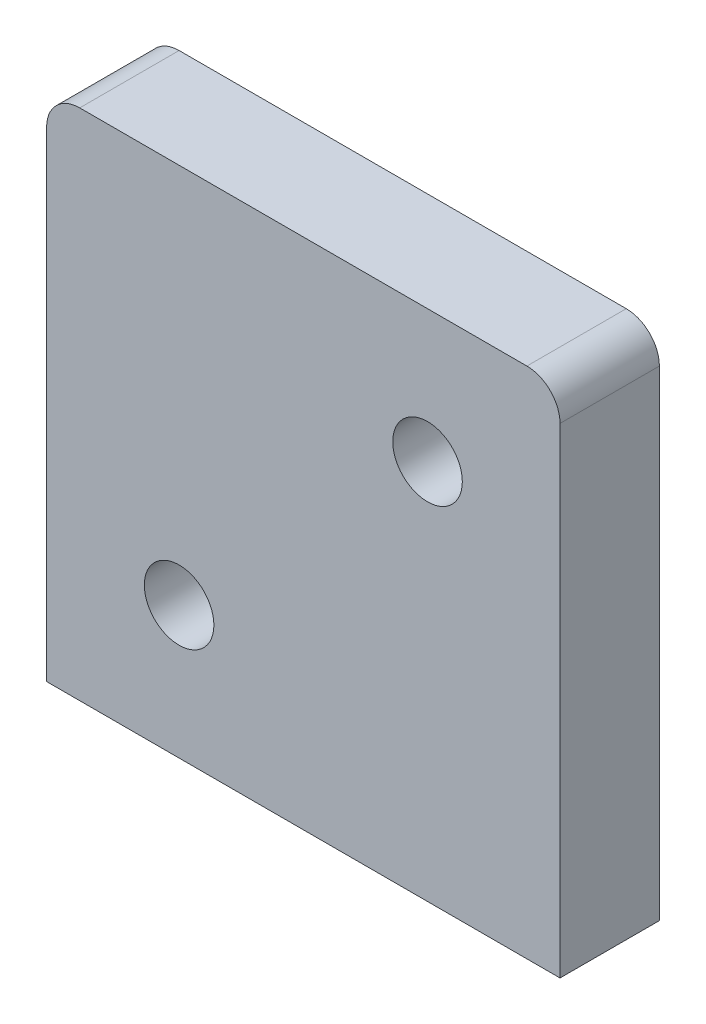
ISO-10303-21;
HEADER;
FILE_DESCRIPTION(('STEP AP214'),'2;1');
FILE_NAME('part.step','',(''),(''),'','','');
FILE_SCHEMA(('AUTOMOTIVE_DESIGN { 1 0 10303 214 1 1 1 1 }'));
ENDSEC;
DATA;
#1=APPLICATION_CONTEXT('core data for automotive mechanical design processes');
#2=APPLICATION_PROTOCOL_DEFINITION('international standard','automotive_design',2000,#1);
#3=PRODUCT_CONTEXT('',#1,'mechanical');
#4=PRODUCT('Part','Part','',(#3));
#5=PRODUCT_RELATED_PRODUCT_CATEGORY('part','',(#4));
#6=PRODUCT_DEFINITION_FORMATION('','',#4);
#7=PRODUCT_DEFINITION_CONTEXT('part definition',#1,'design');
#8=PRODUCT_DEFINITION('design','',#6,#7);
#9=PRODUCT_DEFINITION_SHAPE('','',#8);
#10=(LENGTH_UNIT() NAMED_UNIT(*) SI_UNIT(.MILLI.,.METRE.));
#11=(NAMED_UNIT(*) PLANE_ANGLE_UNIT() SI_UNIT($,.RADIAN.));
#12=(NAMED_UNIT(*) SI_UNIT($,.STERADIAN.) SOLID_ANGLE_UNIT());
#13=UNCERTAINTY_MEASURE_WITH_UNIT(LENGTH_MEASURE(1.E-05),#10,'distance_accuracy_value','');
#14=(GEOMETRIC_REPRESENTATION_CONTEXT(3) GLOBAL_UNCERTAINTY_ASSIGNED_CONTEXT((#13)) GLOBAL_UNIT_ASSIGNED_CONTEXT((#10,
#11,#12)) REPRESENTATION_CONTEXT('',''));
#15=CARTESIAN_POINT('',(0.,0.,0.));
#16=DIRECTION('',(0.,0.,1.));
#17=DIRECTION('',(1.,0.,0.));
#18=AXIS2_PLACEMENT_3D('',#15,#16,#17);
#19=CARTESIAN_POINT('',(2.,29.,6.));
#20=DIRECTION('',(0.,0.,-1.));
#21=DIRECTION('',(-1.,0.,0.));
#22=AXIS2_PLACEMENT_3D('',#19,#20,#21);
#23=PLANE('',#22);
#24=DIRECTION('',(0.,-1.,0.));
#25=VECTOR('',#24,1.);
#26=CARTESIAN_POINT('',(0.,0.,6.));
#27=LINE('',#26,#25);
#28=CARTESIAN_POINT('',(0.,29.,6.));
#29=VERTEX_POINT('',#28);
#30=CARTESIAN_POINT('',(0.,0.,6.));
#31=VERTEX_POINT('',#30);
#32=EDGE_CURVE('E131',#29,#31,#27,.T.);
#33=ORIENTED_EDGE('',*,*,#32,.T.);
#34=DIRECTION('',(1.,0.,0.));
#35=VECTOR('',#34,1.);
#36=CARTESIAN_POINT('',(0.,0.,6.));
#37=LINE('',#36,#35);
#38=CARTESIAN_POINT('',(31.,0.,6.));
#39=VERTEX_POINT('',#38);
#40=EDGE_CURVE('E89',#31,#39,#37,.T.);
#41=ORIENTED_EDGE('',*,*,#40,.T.);
#42=DIRECTION('',(0.,1.,0.));
#43=VECTOR('',#42,1.);
#44=CARTESIAN_POINT('',(31.,0.,6.));
#45=LINE('',#44,#43);
#46=CARTESIAN_POINT('',(31.,29.,6.));
#47=VERTEX_POINT('',#46);
#48=EDGE_CURVE('E102',#39,#47,#45,.T.);
#49=ORIENTED_EDGE('',*,*,#48,.T.);
#50=CARTESIAN_POINT('',(29.,29.,6.));
#51=DIRECTION('',(0.,0.,1.));
#52=DIRECTION('',(-1.,0.,0.));
#53=AXIS2_PLACEMENT_3D('',#50,#51,#52);
#54=CIRCLE('',#53,2.);
#55=CARTESIAN_POINT('',(29.,31.,6.));
#56=VERTEX_POINT('',#55);
#57=EDGE_CURVE('E96',#47,#56,#54,.T.);
#58=ORIENTED_EDGE('',*,*,#57,.T.);
#59=DIRECTION('',(-1.,0.,0.));
#60=VECTOR('',#59,1.);
#61=CARTESIAN_POINT('',(2.00000000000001,31.,6.));
#62=LINE('',#61,#60);
#63=CARTESIAN_POINT('',(2.00000000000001,31.,6.));
#64=VERTEX_POINT('',#63);
#65=EDGE_CURVE('E100',#56,#64,#62,.T.);
#66=ORIENTED_EDGE('',*,*,#65,.T.);
#67=CARTESIAN_POINT('',(2.,29.,6.));
#68=DIRECTION('',(0.,0.,1.));
#69=DIRECTION('',(-1.,0.,0.));
#70=AXIS2_PLACEMENT_3D('',#67,#68,#69);
#71=CIRCLE('',#70,2.);
#72=EDGE_CURVE('E52',#64,#29,#71,.T.);
#73=ORIENTED_EDGE('',*,*,#72,.T.);
#74=EDGE_LOOP('',(#33,#41,#49,#58,#66,#73));
#75=FACE_BOUND('',#74,.T.);
#76=CARTESIAN_POINT('',(23.,23.,6.));
#77=DIRECTION('',(0.,0.,1.));
#78=DIRECTION('',(1.,0.,0.));
#79=AXIS2_PLACEMENT_3D('',#76,#77,#78);
#80=CIRCLE('',#79,2.1);
#81=CARTESIAN_POINT('',(25.1,23.,6.));
#82=VERTEX_POINT('',#81);
#83=EDGE_CURVE('E124',#82,#82,#80,.T.);
#84=ORIENTED_EDGE('',*,*,#83,.F.);
#85=EDGE_LOOP('',(#84));
#86=FACE_BOUND('',#85,.T.);
#87=CARTESIAN_POINT('',(8.,8.,6.));
#88=DIRECTION('',(0.,0.,1.));
#89=DIRECTION('',(1.,0.,0.));
#90=AXIS2_PLACEMENT_3D('',#87,#88,#89);
#91=CIRCLE('',#90,2.1);
#92=CARTESIAN_POINT('',(10.1,8.,6.));
#93=VERTEX_POINT('',#92);
#94=EDGE_CURVE('E172',#93,#93,#91,.T.);
#95=ORIENTED_EDGE('',*,*,#94,.F.);
#96=EDGE_LOOP('',(#95));
#97=FACE_BOUND('',#96,.T.);
#98=ADVANCED_FACE('F35',(#75,#86,#97),#23,.F.);
#99=CARTESIAN_POINT('',(2.,29.,0.));
#100=DIRECTION('',(0.,0.,-1.));
#101=DIRECTION('',(-1.,0.,0.));
#102=AXIS2_PLACEMENT_3D('',#99,#100,#101);
#103=PLANE('',#102);
#104=CARTESIAN_POINT('',(23.,23.,0.));
#105=DIRECTION('',(0.,0.,1.));
#106=DIRECTION('',(1.,0.,0.));
#107=AXIS2_PLACEMENT_3D('',#104,#105,#106);
#108=CIRCLE('',#107,2.1);
#109=CARTESIAN_POINT('',(25.1,23.,0.));
#110=VERTEX_POINT('',#109);
#111=EDGE_CURVE('E177',#110,#110,#108,.T.);
#112=ORIENTED_EDGE('',*,*,#111,.T.);
#113=EDGE_LOOP('',(#112));
#114=FACE_BOUND('',#113,.T.);
#115=DIRECTION('',(0.,-1.,0.));
#116=VECTOR('',#115,1.);
#117=CARTESIAN_POINT('',(0.,0.,0.));
#118=LINE('',#117,#116);
#119=CARTESIAN_POINT('',(0.,29.,0.));
#120=VERTEX_POINT('',#119);
#121=CARTESIAN_POINT('',(0.,0.,0.));
#122=VERTEX_POINT('',#121);
#123=EDGE_CURVE('E120',#120,#122,#118,.T.);
#124=ORIENTED_EDGE('',*,*,#123,.F.);
#125=CARTESIAN_POINT('',(2.,29.,0.));
#126=DIRECTION('',(0.,0.,1.));
#127=DIRECTION('',(-1.,0.,0.));
#128=AXIS2_PLACEMENT_3D('',#125,#126,#127);
#129=CIRCLE('',#128,2.);
#130=CARTESIAN_POINT('',(2.00000000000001,31.,0.));
#131=VERTEX_POINT('',#130);
#132=EDGE_CURVE('E81',#131,#120,#129,.T.);
#133=ORIENTED_EDGE('',*,*,#132,.F.);
#134=DIRECTION('',(-1.,0.,0.));
#135=VECTOR('',#134,1.);
#136=CARTESIAN_POINT('',(2.00000000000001,31.,0.));
#137=LINE('',#136,#135);
#138=CARTESIAN_POINT('',(29.,31.,0.));
#139=VERTEX_POINT('',#138);
#140=EDGE_CURVE('E75',#139,#131,#137,.T.);
#141=ORIENTED_EDGE('',*,*,#140,.F.);
#142=CARTESIAN_POINT('',(29.,29.,0.));
#143=DIRECTION('',(0.,0.,1.));
#144=DIRECTION('',(-1.,0.,0.));
#145=AXIS2_PLACEMENT_3D('',#142,#143,#144);
#146=CIRCLE('',#145,2.);
#147=CARTESIAN_POINT('',(31.,29.,0.));
#148=VERTEX_POINT('',#147);
#149=EDGE_CURVE('E110',#148,#139,#146,.T.);
#150=ORIENTED_EDGE('',*,*,#149,.F.);
#151=DIRECTION('',(0.,1.,0.));
#152=VECTOR('',#151,1.);
#153=CARTESIAN_POINT('',(31.,0.,0.));
#154=LINE('',#153,#152);
#155=CARTESIAN_POINT('',(31.,0.,0.));
#156=VERTEX_POINT('',#155);
#157=EDGE_CURVE('E126',#156,#148,#154,.T.);
#158=ORIENTED_EDGE('',*,*,#157,.F.);
#159=DIRECTION('',(1.,0.,0.));
#160=VECTOR('',#159,1.);
#161=CARTESIAN_POINT('',(0.,0.,0.));
#162=LINE('',#161,#160);
#163=EDGE_CURVE('E123',#122,#156,#162,.T.);
#164=ORIENTED_EDGE('',*,*,#163,.F.);
#165=EDGE_LOOP('',(#124,#133,#141,#150,#158,#164));
#166=FACE_BOUND('',#165,.T.);
#167=CARTESIAN_POINT('',(8.,8.,0.));
#168=DIRECTION('',(0.,0.,1.));
#169=DIRECTION('',(1.,0.,0.));
#170=AXIS2_PLACEMENT_3D('',#167,#168,#169);
#171=CIRCLE('',#170,2.1);
#172=CARTESIAN_POINT('',(10.1,8.,0.));
#173=VERTEX_POINT('',#172);
#174=EDGE_CURVE('E175',#173,#173,#171,.T.);
#175=ORIENTED_EDGE('',*,*,#174,.T.);
#176=EDGE_LOOP('',(#175));
#177=FACE_BOUND('',#176,.T.);
#178=ADVANCED_FACE('F140',(#114,#166,#177),#103,.T.);
#179=CARTESIAN_POINT('',(0.,0.,6.));
#180=DIRECTION('',(1.,0.,0.));
#181=DIRECTION('',(0.,0.,-1.));
#182=AXIS2_PLACEMENT_3D('',#179,#180,#181);
#183=PLANE('',#182);
#184=ORIENTED_EDGE('',*,*,#123,.T.);
#185=DIRECTION('',(0.,0.,-1.));
#186=VECTOR('',#185,1.);
#187=CARTESIAN_POINT('',(0.,0.,6.));
#188=LINE('',#187,#186);
#189=EDGE_CURVE('E11',#31,#122,#188,.T.);
#190=ORIENTED_EDGE('',*,*,#189,.F.);
#191=ORIENTED_EDGE('',*,*,#32,.F.);
#192=DIRECTION('',(0.,0.,-1.));
#193=VECTOR('',#192,1.);
#194=CARTESIAN_POINT('',(0.,29.,6.));
#195=LINE('',#194,#193);
#196=EDGE_CURVE('E116',#29,#120,#195,.T.);
#197=ORIENTED_EDGE('',*,*,#196,.T.);
#198=EDGE_LOOP('',(#184,#190,#191,#197));
#199=FACE_BOUND('',#198,.T.);
#200=ADVANCED_FACE('F37',(#199),#183,.F.);
#201=CARTESIAN_POINT('',(0.,0.,6.));
#202=DIRECTION('',(0.,1.,0.));
#203=DIRECTION('',(0.,0.,1.));
#204=AXIS2_PLACEMENT_3D('',#201,#202,#203);
#205=PLANE('',#204);
#206=ORIENTED_EDGE('',*,*,#163,.T.);
#207=DIRECTION('',(0.,0.,-1.));
#208=VECTOR('',#207,1.);
#209=CARTESIAN_POINT('',(31.,0.,6.));
#210=LINE('',#209,#208);
#211=EDGE_CURVE('E44',#39,#156,#210,.T.);
#212=ORIENTED_EDGE('',*,*,#211,.F.);
#213=ORIENTED_EDGE('',*,*,#40,.F.);
#214=ORIENTED_EDGE('',*,*,#189,.T.);
#215=EDGE_LOOP('',(#206,#212,#213,#214));
#216=FACE_BOUND('',#215,.T.);
#217=ADVANCED_FACE('F220',(#216),#205,.F.);
#218=CARTESIAN_POINT('',(31.,0.,6.));
#219=DIRECTION('',(-1.,0.,0.));
#220=DIRECTION('',(0.,0.,1.));
#221=AXIS2_PLACEMENT_3D('',#218,#219,#220);
#222=PLANE('',#221);
#223=ORIENTED_EDGE('',*,*,#157,.T.);
#224=DIRECTION('',(0.,0.,-1.));
#225=VECTOR('',#224,1.);
#226=CARTESIAN_POINT('',(31.,29.,6.));
#227=LINE('',#226,#225);
#228=EDGE_CURVE('E111',#47,#148,#227,.T.);
#229=ORIENTED_EDGE('',*,*,#228,.F.);
#230=ORIENTED_EDGE('',*,*,#48,.F.);
#231=ORIENTED_EDGE('',*,*,#211,.T.);
#232=EDGE_LOOP('',(#223,#229,#230,#231));
#233=FACE_BOUND('',#232,.T.);
#234=ADVANCED_FACE('F137',(#233),#222,.F.);
#235=CARTESIAN_POINT('',(29.,29.,6.));
#236=DIRECTION('',(0.,0.,-1.));
#237=DIRECTION('',(-1.,0.,0.));
#238=AXIS2_PLACEMENT_3D('',#235,#236,#237);
#239=CYLINDRICAL_SURFACE('',#238,2.);
#240=ORIENTED_EDGE('',*,*,#149,.T.);
#241=DIRECTION('',(0.,0.,-1.));
#242=VECTOR('',#241,1.);
#243=CARTESIAN_POINT('',(29.,31.,6.));
#244=LINE('',#243,#242);
#245=EDGE_CURVE('E107',#56,#139,#244,.T.);
#246=ORIENTED_EDGE('',*,*,#245,.F.);
#247=ORIENTED_EDGE('',*,*,#57,.F.);
#248=ORIENTED_EDGE('',*,*,#228,.T.);
#249=EDGE_LOOP('',(#240,#246,#247,#248));
#250=FACE_BOUND('',#249,.T.);
#251=ADVANCED_FACE('F108',(#250),#239,.T.);
#252=CARTESIAN_POINT('',(2.00000000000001,31.,6.));
#253=DIRECTION('',(0.,-1.,0.));
#254=DIRECTION('',(0.,0.,-1.));
#255=AXIS2_PLACEMENT_3D('',#252,#253,#254);
#256=PLANE('',#255);
#257=ORIENTED_EDGE('',*,*,#140,.T.);
#258=DIRECTION('',(0.,0.,-1.));
#259=VECTOR('',#258,1.);
#260=CARTESIAN_POINT('',(2.00000000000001,31.,6.));
#261=LINE('',#260,#259);
#262=EDGE_CURVE('E112',#64,#131,#261,.T.);
#263=ORIENTED_EDGE('',*,*,#262,.F.);
#264=ORIENTED_EDGE('',*,*,#65,.F.);
#265=ORIENTED_EDGE('',*,*,#245,.T.);
#266=EDGE_LOOP('',(#257,#263,#264,#265));
#267=FACE_BOUND('',#266,.T.);
#268=ADVANCED_FACE('F114',(#267),#256,.F.);
#269=CARTESIAN_POINT('',(2.,29.,6.));
#270=DIRECTION('',(0.,0.,-1.));
#271=DIRECTION('',(-1.,0.,0.));
#272=AXIS2_PLACEMENT_3D('',#269,#270,#271);
#273=CYLINDRICAL_SURFACE('',#272,2.);
#274=ORIENTED_EDGE('',*,*,#132,.T.);
#275=ORIENTED_EDGE('',*,*,#196,.F.);
#276=ORIENTED_EDGE('',*,*,#72,.F.);
#277=ORIENTED_EDGE('',*,*,#262,.T.);
#278=EDGE_LOOP('',(#274,#275,#276,#277));
#279=FACE_BOUND('',#278,.T.);
#280=ADVANCED_FACE('F145',(#279),#273,.T.);
#281=CARTESIAN_POINT('',(23.,23.,6.));
#282=DIRECTION('',(0.,0.,-1.));
#283=DIRECTION('',(-1.,0.,0.));
#284=AXIS2_PLACEMENT_3D('',#281,#282,#283);
#285=CYLINDRICAL_SURFACE('',#284,2.1);
#286=ORIENTED_EDGE('',*,*,#83,.T.);
#287=EDGE_LOOP('',(#286));
#288=FACE_BOUND('',#287,.T.);
#289=ORIENTED_EDGE('',*,*,#111,.F.);
#290=EDGE_LOOP('',(#289));
#291=FACE_BOUND('',#290,.T.);
#292=ADVANCED_FACE('F147',(#288,#291),#285,.F.);
#293=CARTESIAN_POINT('',(8.,8.,6.));
#294=DIRECTION('',(0.,0.,-1.));
#295=DIRECTION('',(-1.,0.,0.));
#296=AXIS2_PLACEMENT_3D('',#293,#294,#295);
#297=CYLINDRICAL_SURFACE('',#296,2.1);
#298=ORIENTED_EDGE('',*,*,#94,.T.);
#299=EDGE_LOOP('',(#298));
#300=FACE_BOUND('',#299,.T.);
#301=ORIENTED_EDGE('',*,*,#174,.F.);
#302=EDGE_LOOP('',(#301));
#303=FACE_BOUND('',#302,.T.);
#304=ADVANCED_FACE('F153',(#300,#303),#297,.F.);
#305=CLOSED_SHELL('',(#98,#178,#200,#217,#234,#251,#268,#280,#292,#304));
#306=MANIFOLD_SOLID_BREP('B2',#305);
#307=ADVANCED_BREP_SHAPE_REPRESENTATION('',(#18,#306),#14);
#308=SHAPE_DEFINITION_REPRESENTATION(#9,#307);
ENDSEC;
END-ISO-10303-21;
